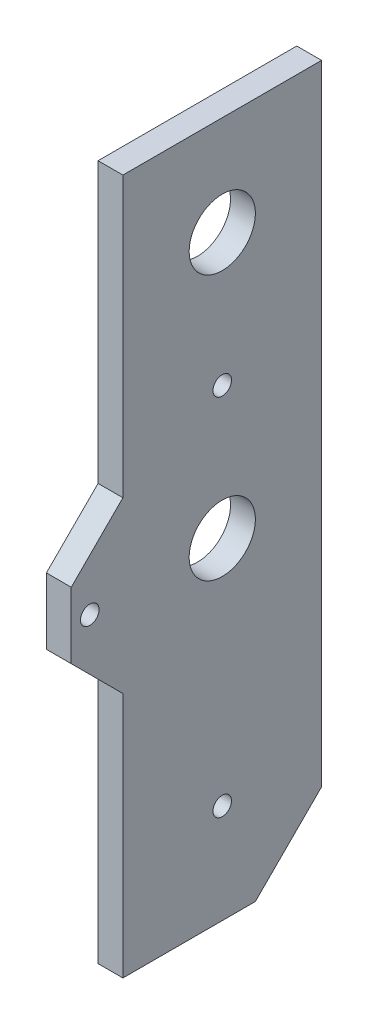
from build123d import *

# Parameters (mm, degrees)
SKETCH1_R           = 6.349999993
SKETCH1_R_2         = 1.777999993
SKETCH1_R_3         = 1.777999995
SKETCH1_R_4         = 1.778
BOSS_EXTRUDE1_DEPTH = 4.7625


with BuildPart() as part:
    # Sketch1 → Boss-Extrude1 (new body)
    with BuildSketch(Plane(origin=(0, 0, 0), x_dir=(0, 0, -1), z_dir=(1, 0, 0))):
        Polygon((8.572606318, 69.849999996), (46.672606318, 69.849999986), (46.672606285, -50.800000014), (33.972606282, -63.500000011), (8.572606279, -63.500000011), (8.572606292, -16.256000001), (-1.333393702, -6.350000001), (-1.333393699, 6.349999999), (8.572606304, 16.255999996), align=None)
        with Locations(Location((27.622606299, -9e-09, 0), (0, 0, 180))):
            Circle(SKETCH1_R, mode=Mode.SUBTRACT)
        with Locations(Location((27.622606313, 50.799999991, 0), (0, 0, 180))):
            Circle(SKETCH1_R, mode=Mode.SUBTRACT)
        with Locations(Location((27.622606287, -44.450000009, 0), (0, 0, 180))):
            Circle(SKETCH1_R_2, mode=Mode.SUBTRACT)
        with Locations(Location((2.222606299, -2e-09, 0), (0, 0, 180))):
            Circle(SKETCH1_R_3, mode=Mode.SUBTRACT)
        with Locations(Location((27.622606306, 25.399999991, 0), (0, 0, 180))):
            Circle(SKETCH1_R_4, mode=Mode.SUBTRACT)
    extrude(amount=BOSS_EXTRUDE1_DEPTH)


solid = part.part
